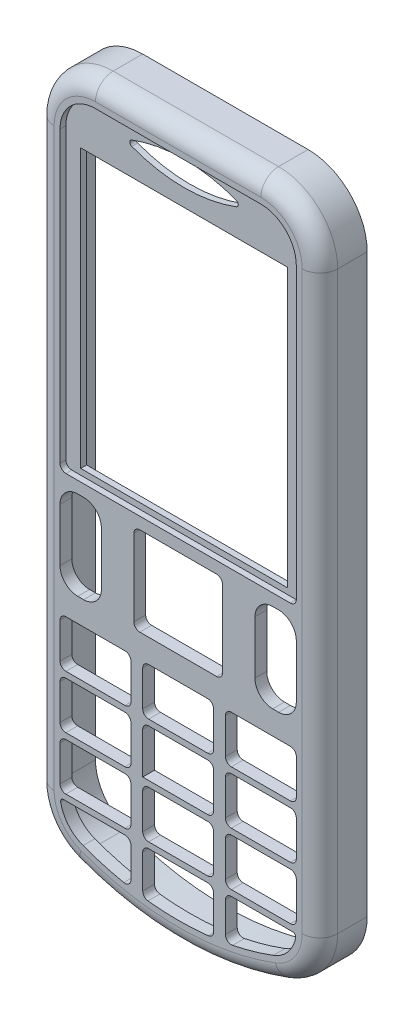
from build123d import *

# Parameters (mm, degrees)
AUFSATZ_LINEAR_AUSTRAGEN1_DEPTH      = 8
VERRUNDUNG1_R                        = 10
VERRUNDUNG2_R                        = 3
SCHALE1_T                            = -2
SKIZZE2_W                            = 35
SKIZZE2_H                            = 47
SCHNITT_LINEAR_AUSTRAGEN1_DEPTH      = 2
VERRUNDUNG3_R                        = 0.5
SCHNITT_LINEAR_AUSTRAGEN2_DEPTH      = 1
VERRUNDUNG4_R                        = 1
SCHNITT_LINEAR_AUSTRAGEN3_DEPTH      = 66.115282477
SCHNITT_LINEAR_AUSTRAGEN3_DEPTH_BACK = 2
SKIZZE4_W                            = 12
SKIZZE4_H                            = 8
VERRUNDUNG5_R                        = 1
VERRUNDUNG6_R                        = 0.5
SKIZZE5_W                            = 7
SKIZZE5_H                            = 15
SKIZZE5_W_2                          = 15
SCHNITT_LINEAR_AUSTRAGEN4_DEPTH      = 2
VERRUNDUNG7_R                        = 1
VERRUNDUNG8_R                        = 3


with BuildPart() as part:
    # Skizze1 → Aufsatz-Linear austragen1 (new body)
    with BuildSketch(Plane.XY):
        with BuildLine():
            Line((-24, -53.863424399), (-24, 60))
            Line((-24, 60), (24, 60))
            Line((24, 60), (24, -53.863424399))
            ThreePointArc((24, -53.863424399), (0, -60), (-24, -53.863424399))
        make_face()
    extrude(amount=-AUFSATZ_LINEAR_AUSTRAGEN1_DEPTH)

    # Verrundung1
    verrundung1_edges = [part.edges().sort_by_distance(p)[0] for p in [
        (24, -53.863424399, -4),
        (-24, -53.863424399, -4),
        (-24, 60, -4),
        (24, 60, -4),
    ]]
    fillet(verrundung1_edges, radius=VERRUNDUNG1_R)

    # Verrundung2
    verrundung2_edges = [part.edges().sort_by_distance(p)[0] for p in [
        (-24, 1.265006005, 0),
        (24, 1.265006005, 0),
        (0, 60, 0),
        (0, -60, 0),
        (21.071067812, 57.071067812, 0),
        (-21.071067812, 57.071067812, 0),
        (22.215838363, -53.170865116, 0),
        (-22.215838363, -53.170865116, 0),
    ]]
    fillet(verrundung2_edges, radius=VERRUNDUNG2_R)

    # Schale1
    schale1_openings = [part.faces().sort_by_distance(p)[0] for p in [
        (0, 0.693931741, -8),
    ]]
    offset(amount=SCHALE1_T, openings=schale1_openings, kind=Kind.INTERSECTION)

    # Skizze2 → Schnitt-Linear austragen1 (cut)
    with BuildSketch(Plane.XY):
        with Locations((0, 24.5)):
            Rectangle(SKIZZE2_W, SKIZZE2_H)
        with BuildLine():
            ThreePointArc((-10, 53), (0, 50.912878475), (10, 53))
            ThreePointArc((10, 53), (0, 55.087121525), (-10, 53))
        make_face()
    extrude(amount=-SCHNITT_LINEAR_AUSTRAGEN1_DEPTH, mode=Mode.SUBTRACT)

    # Verrundung3
    verrundung3_edges = [part.edges().sort_by_distance(p)[0] for p in [
        (-10, 53, -1),
        (10, 53, -1),
    ]]
    fillet(verrundung3_edges, radius=VERRUNDUNG3_R)

    # Skizze3 → Schnitt-Linear austragen2 (cut)
    with BuildSketch(Plane.XY):
        with BuildLine():
            Line((-20, 0), (20, 0))
            Line((20, 0), (20, 50))
            ThreePointArc((20, 50), (18.242640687, 54.242640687), (14, 56))
            Line((14, 56), (-14, 56))
            ThreePointArc((-14, 56), (-18.242640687, 54.242640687), (-20, 50))
            Line((-20, 50), (-20, 0))
        make_face()
    extrude(amount=-SCHNITT_LINEAR_AUSTRAGEN2_DEPTH, mode=Mode.SUBTRACT)

    # Verrundung4
    verrundung4_edges = [part.edges().sort_by_distance(p)[0] for p in [
        (20, 0, -0.5),
        (-20, 0, -0.5),
    ]]
    fillet(verrundung4_edges, radius=VERRUNDUNG4_R)

    # Skizze4 → Schnitt-Linear austragen3 (cut, two sides: drawn at the far end of the back side and taken through both)
    with BuildSketch(Plane.XY.offset(-SCHNITT_LINEAR_AUSTRAGEN3_DEPTH_BACK)):
        with Locations((14, -25)):
            Rectangle(SKIZZE4_W, SKIZZE4_H)
        with Locations((14, -34)):
            Rectangle(SKIZZE4_W, SKIZZE4_H)
        with Locations((14, -43)):
            Rectangle(SKIZZE4_W, SKIZZE4_H)
        with Locations((-14, -25)):
            Rectangle(SKIZZE4_W, SKIZZE4_H)
        with Locations((-14, -34)):
            Rectangle(SKIZZE4_W, SKIZZE4_H)
        with Locations((-14, -43)):
            Rectangle(SKIZZE4_W, SKIZZE4_H)
        with BuildLine():
            ThreePointArc((-16.1, -53.090486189), (-12.100491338, -54.379929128), (-8, -55.299006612))
            Line((-8, -55.299006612), (-8, -48))
            Line((-8, -48), (-19.97654476, -48))
            ThreePointArc((-19.97654476, -48), (-18.773458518, -51.10510749), (-16.1, -53.090486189))
        make_face()
        with Locations((0, -25)):
            Rectangle(SKIZZE4_W, SKIZZE4_H)
        with Locations((0, -34)):
            Rectangle(SKIZZE4_W, SKIZZE4_H)
        with Locations((0, -43)):
            Rectangle(SKIZZE4_W, SKIZZE4_H)
        with BuildLine():
            Line((6, -55.607017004), (6, -48))
            Line((6, -48), (-6, -48))
            Line((-6, -48), (-6, -55.607017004))
            ThreePointArc((-6, -55.607017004), (0, -56), (6, -55.607017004))
        make_face()
        with BuildLine():
            ThreePointArc((16.1, -53.090486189), (18.773458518, -51.10510749), (19.97654476, -48))
            Line((19.97654476, -48), (8, -48))
            Line((8, -48), (8, -55.299006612))
            ThreePointArc((8, -55.299006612), (12.100491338, -54.379929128), (16.1, -53.090486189))
        make_face()
    extrude(amount=SCHNITT_LINEAR_AUSTRAGEN3_DEPTH + SCHNITT_LINEAR_AUSTRAGEN3_DEPTH_BACK, mode=Mode.SUBTRACT)

    # Verrundung5
    verrundung5_edges = [part.edges().sort_by_distance(p)[0] for p in [
        (6, -47, -1),
        (-6, -47, -1),
        (20, -38, -1),
        (8, -38, -1),
        (6, -38, -1),
        (8, -21, -1),
        (8, -48, -1),
        (8, -30, -1),
        (20, -30, -1),
        (20, -21, -1),
        (6, -21, -1),
        (-6, -21, -1),
        (-6, -30, -1),
        (6, -30, -1),
        (6, -39, -1),
        (-6, -39, -1),
        (-6, -55.607017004, -1),
        (-6, -48, -1),
        (6, -48, -1),
        (6, -55.607017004, -1),
        (-8, -55.299006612, -1),
        (-8, -48, -1),
        (-8, -47, -1),
        (-8, -39, -1),
        (-20, -39, -1),
        (-20, -38, -1),
        (-20, -30, -1),
        (-8, -30, -1),
        (-8, -38, -1),
        (-8, -29, -1),
        (-20, -29, -1),
        (-20, -21, -1),
        (-8, -21, -1),
        (20, -29, -1),
        (6, -29, -1),
        (-6, -29, -1),
        (8, -29, -1),
        (8, -55.299006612, -1),
        (8, -39, -1),
        (20, -39, -1),
        (20, -47, -1),
        (8, -47, -1),
        (-20, -47, -1),
    ]]
    fillet(verrundung5_edges, radius=VERRUNDUNG5_R)

    # Verrundung6
    verrundung6_edges = [part.edges().sort_by_distance(p)[0] for p in [
        (-19.97654476, -48, -1),
        (19.97654476, -48, -1),
    ]]
    fillet(verrundung6_edges, radius=VERRUNDUNG6_R)

    # Skizze5 → Schnitt-Linear austragen4 (cut)
    with BuildSketch(Plane.XY):
        with Locations((-16.5, -9.5)):
            Rectangle(SKIZZE5_W, SKIZZE5_H)
        with Locations((16.5, -9.5)):
            Rectangle(SKIZZE5_W, SKIZZE5_H)
        with Locations((0, -9.5)):
            Rectangle(SKIZZE5_W_2, SKIZZE5_H)
    extrude(amount=-SCHNITT_LINEAR_AUSTRAGEN4_DEPTH, mode=Mode.SUBTRACT)

    # Verrundung7
    verrundung7_edges = [part.edges().sort_by_distance(p)[0] for p in [
        (-7.5, -17, -1),
        (-7.5, -2, -1),
        (7.5, -2, -1),
        (7.5, -17, -1),
    ]]
    fillet(verrundung7_edges, radius=VERRUNDUNG7_R)

    # Verrundung8
    verrundung8_edges = [part.edges().sort_by_distance(p)[0] for p in [
        (-20, -17, -1),
        (-20, -2, -1),
        (-13, -2, -1),
        (-13, -17, -1),
        (13, -17, -1),
        (13, -2, -1),
        (20, -2, -1),
        (20, -17, -1),
    ]]
    fillet(verrundung8_edges, radius=VERRUNDUNG8_R)


solid = part.part
